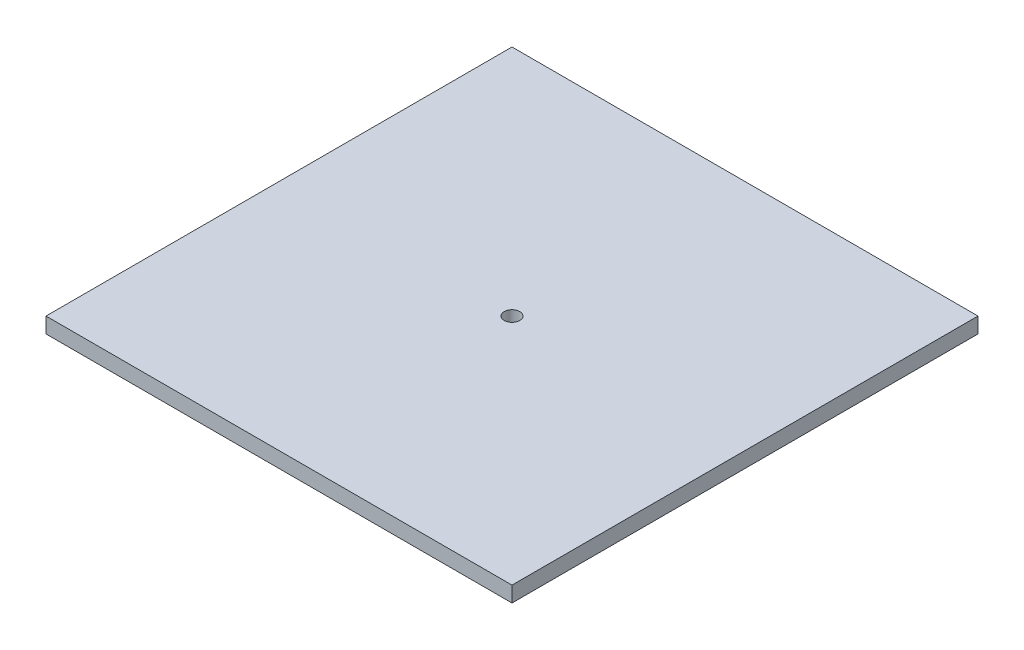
ISO-10303-21;
HEADER;
FILE_DESCRIPTION(('STEP AP214'),'2;1');
FILE_NAME('part.step','',(''),(''),'','','');
FILE_SCHEMA(('AUTOMOTIVE_DESIGN { 1 0 10303 214 1 1 1 1 }'));
ENDSEC;
DATA;
#1=APPLICATION_CONTEXT('core data for automotive mechanical design processes');
#2=APPLICATION_PROTOCOL_DEFINITION('international standard','automotive_design',2000,#1);
#3=PRODUCT_CONTEXT('',#1,'mechanical');
#4=PRODUCT('Part','Part','',(#3));
#5=PRODUCT_RELATED_PRODUCT_CATEGORY('part','',(#4));
#6=PRODUCT_DEFINITION_FORMATION('','',#4);
#7=PRODUCT_DEFINITION_CONTEXT('part definition',#1,'design');
#8=PRODUCT_DEFINITION('design','',#6,#7);
#9=PRODUCT_DEFINITION_SHAPE('','',#8);
#10=(LENGTH_UNIT() NAMED_UNIT(*) SI_UNIT(.MILLI.,.METRE.));
#11=(NAMED_UNIT(*) PLANE_ANGLE_UNIT() SI_UNIT($,.RADIAN.));
#12=(NAMED_UNIT(*) SI_UNIT($,.STERADIAN.) SOLID_ANGLE_UNIT());
#13=UNCERTAINTY_MEASURE_WITH_UNIT(LENGTH_MEASURE(1.E-05),#10,'distance_accuracy_value','');
#14=(GEOMETRIC_REPRESENTATION_CONTEXT(3) GLOBAL_UNCERTAINTY_ASSIGNED_CONTEXT((#13)) GLOBAL_UNIT_ASSIGNED_CONTEXT((#10,
#11,#12)) REPRESENTATION_CONTEXT('',''));
#15=CARTESIAN_POINT('',(0.,0.,0.));
#16=DIRECTION('',(0.,0.,1.));
#17=DIRECTION('',(1.,0.,0.));
#18=AXIS2_PLACEMENT_3D('',#15,#16,#17);
#19=CARTESIAN_POINT('',(0.,6.,-180.));
#20=DIRECTION('',(0.,-1.,0.));
#21=DIRECTION('',(0.,0.,-1.));
#22=AXIS2_PLACEMENT_3D('',#19,#20,#21);
#23=PLANE('',#22);
#24=DIRECTION('',(0.,0.,1.));
#25=VECTOR('',#24,1.);
#26=CARTESIAN_POINT('',(0.,6.,0.));
#27=LINE('',#26,#25);
#28=CARTESIAN_POINT('',(0.,6.,-180.));
#29=VERTEX_POINT('',#28);
#30=CARTESIAN_POINT('',(0.,6.,0.));
#31=VERTEX_POINT('',#30);
#32=EDGE_CURVE('E95',#29,#31,#27,.T.);
#33=ORIENTED_EDGE('',*,*,#32,.T.);
#34=DIRECTION('',(1.,0.,0.));
#35=VECTOR('',#34,1.);
#36=CARTESIAN_POINT('',(0.,6.,0.));
#37=LINE('',#36,#35);
#38=CARTESIAN_POINT('',(180.,6.,0.));
#39=VERTEX_POINT('',#38);
#40=EDGE_CURVE('E80',#31,#39,#37,.T.);
#41=ORIENTED_EDGE('',*,*,#40,.T.);
#42=DIRECTION('',(0.,0.,-1.));
#43=VECTOR('',#42,1.);
#44=CARTESIAN_POINT('',(180.,6.,0.));
#45=LINE('',#44,#43);
#46=CARTESIAN_POINT('',(180.,6.,-180.));
#47=VERTEX_POINT('',#46);
#48=EDGE_CURVE('E46',#39,#47,#45,.T.);
#49=ORIENTED_EDGE('',*,*,#48,.T.);
#50=DIRECTION('',(-1.,0.,0.));
#51=VECTOR('',#50,1.);
#52=CARTESIAN_POINT('',(0.,6.,-180.));
#53=LINE('',#52,#51);
#54=EDGE_CURVE('E41',#47,#29,#53,.T.);
#55=ORIENTED_EDGE('',*,*,#54,.T.);
#56=EDGE_LOOP('',(#33,#41,#49,#55));
#57=FACE_BOUND('',#56,.T.);
#58=CARTESIAN_POINT('',(90.,6.,-90.));
#59=DIRECTION('',(0.,1.,0.));
#60=DIRECTION('',(0.,0.,1.));
#61=AXIS2_PLACEMENT_3D('',#58,#59,#60);
#62=CIRCLE('',#61,3.00000000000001);
#63=CARTESIAN_POINT('',(90.,6.,-87.));
#64=VERTEX_POINT('',#63);
#65=EDGE_CURVE('E85',#64,#64,#62,.T.);
#66=ORIENTED_EDGE('',*,*,#65,.F.);
#67=EDGE_LOOP('',(#66));
#68=FACE_BOUND('',#67,.T.);
#69=ADVANCED_FACE('F26',(#57,#68),#23,.F.);
#70=CARTESIAN_POINT('',(0.,0.,-180.));
#71=DIRECTION('',(0.,-1.,0.));
#72=DIRECTION('',(0.,0.,-1.));
#73=AXIS2_PLACEMENT_3D('',#70,#71,#72);
#74=PLANE('',#73);
#75=DIRECTION('',(0.,0.,1.));
#76=VECTOR('',#75,1.);
#77=CARTESIAN_POINT('',(0.,0.,0.));
#78=LINE('',#77,#76);
#79=CARTESIAN_POINT('',(0.,0.,-180.));
#80=VERTEX_POINT('',#79);
#81=CARTESIAN_POINT('',(0.,0.,0.));
#82=VERTEX_POINT('',#81);
#83=EDGE_CURVE('E72',#80,#82,#78,.T.);
#84=ORIENTED_EDGE('',*,*,#83,.F.);
#85=DIRECTION('',(-1.,0.,0.));
#86=VECTOR('',#85,1.);
#87=CARTESIAN_POINT('',(0.,0.,-180.));
#88=LINE('',#87,#86);
#89=CARTESIAN_POINT('',(180.,0.,-180.));
#90=VERTEX_POINT('',#89);
#91=EDGE_CURVE('E93',#90,#80,#88,.T.);
#92=ORIENTED_EDGE('',*,*,#91,.F.);
#93=DIRECTION('',(0.,0.,-1.));
#94=VECTOR('',#93,1.);
#95=CARTESIAN_POINT('',(180.,0.,0.));
#96=LINE('',#95,#94);
#97=CARTESIAN_POINT('',(180.,0.,0.));
#98=VERTEX_POINT('',#97);
#99=EDGE_CURVE('E73',#98,#90,#96,.T.);
#100=ORIENTED_EDGE('',*,*,#99,.F.);
#101=DIRECTION('',(1.,0.,0.));
#102=VECTOR('',#101,1.);
#103=CARTESIAN_POINT('',(0.,0.,0.));
#104=LINE('',#103,#102);
#105=EDGE_CURVE('E67',#82,#98,#104,.T.);
#106=ORIENTED_EDGE('',*,*,#105,.F.);
#107=EDGE_LOOP('',(#84,#92,#100,#106));
#108=FACE_BOUND('',#107,.T.);
#109=CARTESIAN_POINT('',(90.,0.,-90.));
#110=DIRECTION('',(0.,1.,0.));
#111=DIRECTION('',(0.,0.,1.));
#112=AXIS2_PLACEMENT_3D('',#109,#110,#111);
#113=CIRCLE('',#112,3.00000000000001);
#114=CARTESIAN_POINT('',(90.,0.,-87.));
#115=VERTEX_POINT('',#114);
#116=EDGE_CURVE('E88',#115,#115,#113,.T.);
#117=ORIENTED_EDGE('',*,*,#116,.T.);
#118=EDGE_LOOP('',(#117));
#119=FACE_BOUND('',#118,.T.);
#120=ADVANCED_FACE('F68',(#108,#119),#74,.T.);
#121=CARTESIAN_POINT('',(0.,6.,0.));
#122=DIRECTION('',(1.,0.,0.));
#123=DIRECTION('',(0.,0.,-1.));
#124=AXIS2_PLACEMENT_3D('',#121,#122,#123);
#125=PLANE('',#124);
#126=ORIENTED_EDGE('',*,*,#83,.T.);
#127=DIRECTION('',(0.,-1.,0.));
#128=VECTOR('',#127,1.);
#129=CARTESIAN_POINT('',(0.,6.,0.));
#130=LINE('',#129,#128);
#131=EDGE_CURVE('E11',#31,#82,#130,.T.);
#132=ORIENTED_EDGE('',*,*,#131,.F.);
#133=ORIENTED_EDGE('',*,*,#32,.F.);
#134=DIRECTION('',(0.,-1.,0.));
#135=VECTOR('',#134,1.);
#136=CARTESIAN_POINT('',(0.,6.,-180.));
#137=LINE('',#136,#135);
#138=EDGE_CURVE('E84',#29,#80,#137,.T.);
#139=ORIENTED_EDGE('',*,*,#138,.T.);
#140=EDGE_LOOP('',(#126,#132,#133,#139));
#141=FACE_BOUND('',#140,.T.);
#142=ADVANCED_FACE('F28',(#141),#125,.F.);
#143=CARTESIAN_POINT('',(0.,6.,0.));
#144=DIRECTION('',(0.,0.,-1.));
#145=DIRECTION('',(-1.,0.,0.));
#146=AXIS2_PLACEMENT_3D('',#143,#144,#145);
#147=PLANE('',#146);
#148=ORIENTED_EDGE('',*,*,#105,.T.);
#149=DIRECTION('',(0.,-1.,0.));
#150=VECTOR('',#149,1.);
#151=CARTESIAN_POINT('',(180.,6.,0.));
#152=LINE('',#151,#150);
#153=EDGE_CURVE('E34',#39,#98,#152,.T.);
#154=ORIENTED_EDGE('',*,*,#153,.F.);
#155=ORIENTED_EDGE('',*,*,#40,.F.);
#156=ORIENTED_EDGE('',*,*,#131,.T.);
#157=EDGE_LOOP('',(#148,#154,#155,#156));
#158=FACE_BOUND('',#157,.T.);
#159=ADVANCED_FACE('F79',(#158),#147,.F.);
#160=CARTESIAN_POINT('',(180.,6.,0.));
#161=DIRECTION('',(-1.,0.,0.));
#162=DIRECTION('',(0.,0.,1.));
#163=AXIS2_PLACEMENT_3D('',#160,#161,#162);
#164=PLANE('',#163);
#165=ORIENTED_EDGE('',*,*,#99,.T.);
#166=DIRECTION('',(0.,-1.,0.));
#167=VECTOR('',#166,1.);
#168=CARTESIAN_POINT('',(180.,6.,-180.));
#169=LINE('',#168,#167);
#170=EDGE_CURVE('E101',#47,#90,#169,.T.);
#171=ORIENTED_EDGE('',*,*,#170,.F.);
#172=ORIENTED_EDGE('',*,*,#48,.F.);
#173=ORIENTED_EDGE('',*,*,#153,.T.);
#174=EDGE_LOOP('',(#165,#171,#172,#173));
#175=FACE_BOUND('',#174,.T.);
#176=ADVANCED_FACE('F104',(#175),#164,.F.);
#177=CARTESIAN_POINT('',(0.,6.,-180.));
#178=DIRECTION('',(0.,0.,1.));
#179=DIRECTION('',(1.,0.,0.));
#180=AXIS2_PLACEMENT_3D('',#177,#178,#179);
#181=PLANE('',#180);
#182=ORIENTED_EDGE('',*,*,#91,.T.);
#183=ORIENTED_EDGE('',*,*,#138,.F.);
#184=ORIENTED_EDGE('',*,*,#54,.F.);
#185=ORIENTED_EDGE('',*,*,#170,.T.);
#186=EDGE_LOOP('',(#182,#183,#184,#185));
#187=FACE_BOUND('',#186,.T.);
#188=ADVANCED_FACE('F106',(#187),#181,.F.);
#189=CARTESIAN_POINT('',(90.,6.,-90.));
#190=DIRECTION('',(0.,-1.,0.));
#191=DIRECTION('',(0.,0.,-1.));
#192=AXIS2_PLACEMENT_3D('',#189,#190,#191);
#193=CYLINDRICAL_SURFACE('',#192,3.00000000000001);
#194=ORIENTED_EDGE('',*,*,#65,.T.);
#195=EDGE_LOOP('',(#194));
#196=FACE_BOUND('',#195,.T.);
#197=ORIENTED_EDGE('',*,*,#116,.F.);
#198=EDGE_LOOP('',(#197));
#199=FACE_BOUND('',#198,.T.);
#200=ADVANCED_FACE('F112',(#196,#199),#193,.F.);
#201=CLOSED_SHELL('',(#69,#120,#142,#159,#176,#188,#200));
#202=MANIFOLD_SOLID_BREP('B2',#201);
#203=ADVANCED_BREP_SHAPE_REPRESENTATION('',(#18,#202),#14);
#204=SHAPE_DEFINITION_REPRESENTATION(#9,#203);
ENDSEC;
END-ISO-10303-21;
